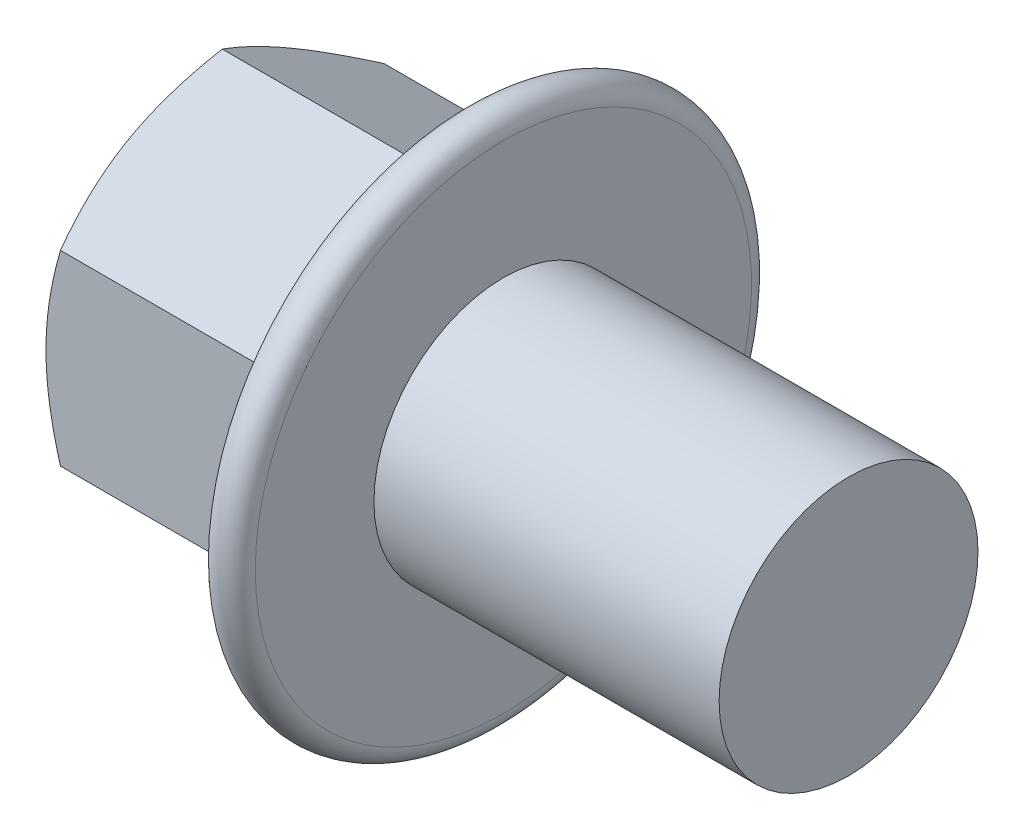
from build123d import *

# Parameters (mm, degrees)
HEX_DIE_START     = -2e-06
SKETCH2_R         = 8.747113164
HEX_DIE_DEPTH     = 13.700002
FLANGEHEXFILLET_R = 0.7
SKETCH4_R         = 6.5625
INDENT_DEPTH      = 1.141666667


with BuildPart() as part:
    # BodySke → Base-Revolve (revolve)
    with BuildSketch(Plane.XY, mode=Mode.PRIVATE) as base_revolve_sk:
        Polygon((13.7, 6), (13.7, 8.660508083), (0.670019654, 8.660508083), (0, 7.5), (0, 0), (29.7, 0), (29.7, 6), align=None)
    revolve(base_revolve_sk.sketch.rotate(Axis((-25.4, 0, 0), (1, 0, 0)), 90), axis=Axis((-25.4, 0, 0), (1, 0, 0)))

    # Sketch2 → Hex-Die (cut)
    with BuildSketch(Plane(origin=(0, 0, 0), x_dir=(0, 0, -1), z_dir=(1, 0, 0)).offset(HEX_DIE_START)):
        Circle(SKETCH2_R)
        Polygon((-7.5, 4.330127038), (0, 8.660254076), (7.5, 4.330127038), (7.5, -4.330127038), (0, -8.660254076), (-7.5, -4.330127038), align=None, mode=Mode.SUBTRACT)
    extrude(amount=HEX_DIE_DEPTH, mode=Mode.SUBTRACT)

    # Sketch5 → Flange (revolve)
    with BuildSketch(Plane.XY, mode=Mode.PRIVATE) as flange_sk:
        with BuildLine():
            Line((7.656582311, 0), (11.954276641, 11.807818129))
            ThreePointArc((11.954276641, 11.807818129), (12.95628336, 12.386326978), (13.7, 11.5))
            Line((13.7, 11.5), (13.7, 0))
            Line((13.7, 0), (7.656582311, 0))
        make_face()
    revolve(flange_sk.sketch.rotate(Axis((0, 0, 0), (1, 0, 0)), 90), axis=Axis((0, 0, 0), (1, 0, 0)))

    # FlangeHexFillet
    flangehexfillet_edges = [part.edges().sort_by_distance(p)[0] for p in [
        (10.498779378, 2.17450823, 7.5),
        (10.386359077, 6.495190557, 3.75),
        (10.386359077, 6.495190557, -3.75),
        (10.386359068, 0, -7.5),
        (10.386359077, -6.495190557, -3.75),
        (10.386359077, -6.495190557, 3.75),
        (10.498779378, -2.17450823, 7.5),
    ]]
    fillet(flangehexfillet_edges, radius=FLANGEHEXFILLET_R)

    # Sketch4 → Indent (cut)
    with BuildSketch(Plane(origin=(0, 0, 0), x_dir=(0, 0, -1), z_dir=(1, 0, 0))):
        Circle(SKETCH4_R)
    extrude(amount=INDENT_DEPTH, mode=Mode.SUBTRACT)


solid = part.part
